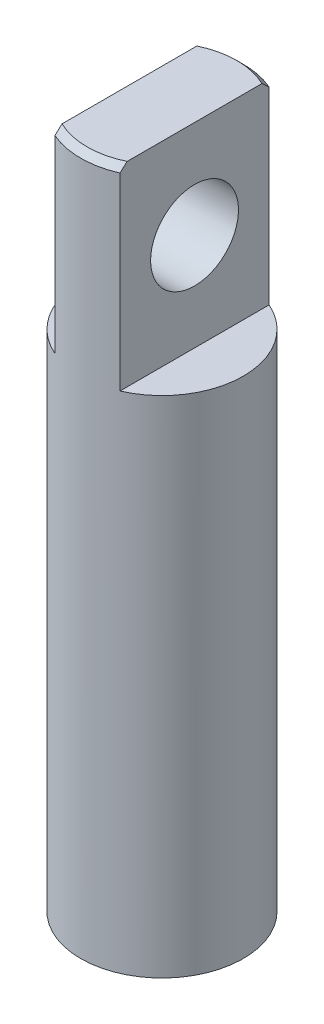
ISO-10303-21;
HEADER;
FILE_DESCRIPTION(('STEP AP214'),'2;1');
FILE_NAME('part.step','',(''),(''),'','','');
FILE_SCHEMA(('AUTOMOTIVE_DESIGN { 1 0 10303 214 1 1 1 1 }'));
ENDSEC;
DATA;
#1=APPLICATION_CONTEXT('core data for automotive mechanical design processes');
#2=APPLICATION_PROTOCOL_DEFINITION('international standard','automotive_design',2000,#1);
#3=PRODUCT_CONTEXT('',#1,'mechanical');
#4=PRODUCT('Part','Part','',(#3));
#5=PRODUCT_RELATED_PRODUCT_CATEGORY('part','',(#4));
#6=PRODUCT_DEFINITION_FORMATION('','',#4);
#7=PRODUCT_DEFINITION_CONTEXT('part definition',#1,'design');
#8=PRODUCT_DEFINITION('design','',#6,#7);
#9=PRODUCT_DEFINITION_SHAPE('','',#8);
#10=(LENGTH_UNIT() NAMED_UNIT(*) SI_UNIT(.MILLI.,.METRE.));
#11=(NAMED_UNIT(*) PLANE_ANGLE_UNIT() SI_UNIT($,.RADIAN.));
#12=(NAMED_UNIT(*) SI_UNIT($,.STERADIAN.) SOLID_ANGLE_UNIT());
#13=UNCERTAINTY_MEASURE_WITH_UNIT(LENGTH_MEASURE(1.E-05),#10,'distance_accuracy_value','');
#14=(GEOMETRIC_REPRESENTATION_CONTEXT(3) GLOBAL_UNCERTAINTY_ASSIGNED_CONTEXT((#13)) GLOBAL_UNIT_ASSIGNED_CONTEXT((#10,
#11,#12)) REPRESENTATION_CONTEXT('',''));
#15=CARTESIAN_POINT('',(0.,0.,0.));
#16=DIRECTION('',(0.,0.,1.));
#17=DIRECTION('',(1.,0.,0.));
#18=AXIS2_PLACEMENT_3D('',#15,#16,#17);
#19=CARTESIAN_POINT('',(0.,15.5,0.));
#20=DIRECTION('',(0.,1.,0.));
#21=DIRECTION('',(0.,0.,1.));
#22=AXIS2_PLACEMENT_3D('',#19,#20,#21);
#23=PLANE('',#22);
#24=DIRECTION('',(0.,0.,-1.));
#25=VECTOR('',#24,1.);
#26=CARTESIAN_POINT('',(1.,15.5,2.29128784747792));
#27=LINE('',#26,#25);
#28=CARTESIAN_POINT('',(1.,15.5,2.29128784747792));
#29=VERTEX_POINT('',#28);
#30=CARTESIAN_POINT('',(1.,15.5,-2.29128784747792));
#31=VERTEX_POINT('',#30);
#32=EDGE_CURVE('E110',#29,#31,#27,.T.);
#33=ORIENTED_EDGE('',*,*,#32,.F.);
#34=CARTESIAN_POINT('',(0.,15.5,0.));
#35=DIRECTION('',(0.,1.,0.));
#36=DIRECTION('',(0.,0.,1.));
#37=AXIS2_PLACEMENT_3D('',#34,#35,#36);
#38=CIRCLE('',#37,2.5);
#39=EDGE_CURVE('E105',#29,#31,#38,.T.);
#40=ORIENTED_EDGE('',*,*,#39,.T.);
#41=EDGE_LOOP('',(#33,#40));
#42=FACE_BOUND('',#41,.T.);
#43=ADVANCED_FACE('F32',(#42),#23,.T.);
#44=CARTESIAN_POINT('',(0.,15.5,0.));
#45=DIRECTION('',(0.,-1.,0.));
#46=DIRECTION('',(0.,0.,-1.));
#47=AXIS2_PLACEMENT_3D('',#44,#45,#46);
#48=CYLINDRICAL_SURFACE('',#47,2.5);
#49=DIRECTION('',(0.,-1.,0.));
#50=VECTOR('',#49,1.);
#51=CARTESIAN_POINT('',(-1.,21.5,-2.29128784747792));
#52=LINE('',#51,#50);
#53=CARTESIAN_POINT('',(-1.,21.3,-2.29128784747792));
#54=VERTEX_POINT('',#53);
#55=CARTESIAN_POINT('',(-1.,15.5,-2.29128784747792));
#56=VERTEX_POINT('',#55);
#57=EDGE_CURVE('E98',#54,#56,#52,.T.);
#58=ORIENTED_EDGE('',*,*,#57,.F.);
#59=CARTESIAN_POINT('',(0.,21.3,0.));
#60=DIRECTION('',(0.,1.,0.));
#61=DIRECTION('',(0.,0.,1.));
#62=AXIS2_PLACEMENT_3D('',#59,#60,#61);
#63=CIRCLE('',#62,2.5);
#64=CARTESIAN_POINT('',(1.,21.3,-2.29128784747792));
#65=VERTEX_POINT('',#64);
#66=EDGE_CURVE('E52',#54,#65,#63,.F.);
#67=ORIENTED_EDGE('',*,*,#66,.T.);
#68=DIRECTION('',(0.,-1.,0.));
#69=VECTOR('',#68,1.);
#70=CARTESIAN_POINT('',(1.,21.5,-2.29128784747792));
#71=LINE('',#70,#69);
#72=EDGE_CURVE('E139',#65,#31,#71,.T.);
#73=ORIENTED_EDGE('',*,*,#72,.T.);
#74=ORIENTED_EDGE('',*,*,#39,.F.);
#75=DIRECTION('',(0.,-1.,0.));
#76=VECTOR('',#75,1.);
#77=CARTESIAN_POINT('',(1.,21.5,2.29128784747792));
#78=LINE('',#77,#76);
#79=CARTESIAN_POINT('',(1.,21.3,2.29128784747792));
#80=VERTEX_POINT('',#79);
#81=EDGE_CURVE('E99',#80,#29,#78,.T.);
#82=ORIENTED_EDGE('',*,*,#81,.F.);
#83=CARTESIAN_POINT('',(0.,21.3,0.));
#84=DIRECTION('',(0.,1.,0.));
#85=DIRECTION('',(0.,0.,1.));
#86=AXIS2_PLACEMENT_3D('',#83,#84,#85);
#87=CIRCLE('',#86,2.5);
#88=CARTESIAN_POINT('',(-1.,21.3,2.29128784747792));
#89=VERTEX_POINT('',#88);
#90=EDGE_CURVE('E94',#80,#89,#87,.F.);
#91=ORIENTED_EDGE('',*,*,#90,.T.);
#92=DIRECTION('',(0.,-1.,0.));
#93=VECTOR('',#92,1.);
#94=CARTESIAN_POINT('',(-1.,21.5,2.29128784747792));
#95=LINE('',#94,#93);
#96=CARTESIAN_POINT('',(-1.,15.5,2.29128784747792));
#97=VERTEX_POINT('',#96);
#98=EDGE_CURVE('E88',#89,#97,#95,.T.);
#99=ORIENTED_EDGE('',*,*,#98,.T.);
#100=EDGE_CURVE('E92',#56,#97,#38,.T.);
#101=ORIENTED_EDGE('',*,*,#100,.F.);
#102=EDGE_LOOP('',(#58,#67,#73,#74,#82,#91,#99,#101));
#103=FACE_BOUND('',#102,.T.);
#104=CARTESIAN_POINT('',(0.,0.,0.));
#105=DIRECTION('',(0.,1.,0.));
#106=DIRECTION('',(0.,0.,1.));
#107=AXIS2_PLACEMENT_3D('',#104,#105,#106);
#108=CIRCLE('',#107,2.5);
#109=CARTESIAN_POINT('',(0.,0.,2.5));
#110=VERTEX_POINT('',#109);
#111=EDGE_CURVE('E106',#110,#110,#108,.T.);
#112=ORIENTED_EDGE('',*,*,#111,.T.);
#113=EDGE_LOOP('',(#112));
#114=FACE_BOUND('',#113,.T.);
#115=ADVANCED_FACE('F90',(#103,#114),#48,.T.);
#116=DIRECTION('',(0.,0.,1.));
#117=VECTOR('',#116,1.);
#118=CARTESIAN_POINT('',(-1.,15.5,2.29128784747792));
#119=LINE('',#118,#117);
#120=EDGE_CURVE('E104',#56,#97,#119,.T.);
#121=ORIENTED_EDGE('',*,*,#120,.F.);
#122=ORIENTED_EDGE('',*,*,#100,.T.);
#123=EDGE_LOOP('',(#121,#122));
#124=FACE_BOUND('',#123,.T.);
#125=ADVANCED_FACE('F103',(#124),#23,.T.);
#126=CARTESIAN_POINT('',(0.,0.,0.));
#127=DIRECTION('',(0.,1.,0.));
#128=DIRECTION('',(0.,0.,1.));
#129=AXIS2_PLACEMENT_3D('',#126,#127,#128);
#130=PLANE('',#129);
#131=ORIENTED_EDGE('',*,*,#111,.F.);
#132=EDGE_LOOP('',(#131));
#133=FACE_BOUND('',#132,.T.);
#134=ADVANCED_FACE('F160',(#133),#130,.F.);
#135=CARTESIAN_POINT('',(-1.,21.5,2.29128784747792));
#136=DIRECTION('',(1.,0.,0.));
#137=DIRECTION('',(0.,0.,-1.));
#138=AXIS2_PLACEMENT_3D('',#135,#136,#137);
#139=PLANE('',#138);
#140=CARTESIAN_POINT('',(-1.,18.5,0.));
#141=DIRECTION('',(-1.,0.,0.));
#142=DIRECTION('',(0.,0.,1.));
#143=AXIS2_PLACEMENT_3D('',#140,#141,#142);
#144=CIRCLE('',#143,1.35);
#145=CARTESIAN_POINT('',(-1.,18.5,1.35));
#146=VERTEX_POINT('',#145);
#147=EDGE_CURVE('E117',#146,#146,#144,.T.);
#148=ORIENTED_EDGE('',*,*,#147,.F.);
#149=EDGE_LOOP('',(#148));
#150=FACE_BOUND('',#149,.T.);
#151=DIRECTION('',(0.,0.,1.));
#152=VECTOR('',#151,1.);
#153=CARTESIAN_POINT('',(-1.,21.5,2.29128784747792));
#154=LINE('',#153,#152);
#155=CARTESIAN_POINT('',(-1.,21.5,-2.0712315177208));
#156=VERTEX_POINT('',#155);
#157=CARTESIAN_POINT('',(-1.,21.5,2.07123151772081));
#158=VERTEX_POINT('',#157);
#159=EDGE_CURVE('E114',#156,#158,#154,.T.);
#160=ORIENTED_EDGE('',*,*,#159,.F.);
#161=CARTESIAN_POINT('',(-1.,21.5,-2.0712315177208));
#162=CARTESIAN_POINT('',(-1.,21.4668268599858,-2.10805317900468));
#163=CARTESIAN_POINT('',(-1.,21.4335736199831,-2.14480204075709));
#164=CARTESIAN_POINT('',(-1.,21.3669069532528,-2.21815415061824));
#165=CARTESIAN_POINT('',(-1.,21.3334935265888,-2.25475739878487));
#166=CARTESIAN_POINT('',(-1.,21.3,-2.29128784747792));
#167=B_SPLINE_CURVE_WITH_KNOTS('',3,(#161,#162,#163,#164,#165,#166),.UNSPECIFIED.,.F.,.F.,(4,2,
4),(0.,0.148681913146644,0.29736376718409),.UNSPECIFIED.);
#168=EDGE_CURVE('E144',#156,#54,#167,.T.);
#169=ORIENTED_EDGE('',*,*,#168,.T.);
#170=ORIENTED_EDGE('',*,*,#57,.T.);
#171=ORIENTED_EDGE('',*,*,#120,.T.);
#172=ORIENTED_EDGE('',*,*,#98,.F.);
#173=CARTESIAN_POINT('',(-1.,21.3,2.29128784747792));
#174=CARTESIAN_POINT('',(-1.,21.3334935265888,2.25475739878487));
#175=CARTESIAN_POINT('',(-1.,21.3669069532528,2.21815415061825));
#176=CARTESIAN_POINT('',(-1.,21.4335736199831,2.14480204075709));
#177=CARTESIAN_POINT('',(-1.,21.4668268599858,2.10805317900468));
#178=CARTESIAN_POINT('',(-1.,21.5,2.07123151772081));
#179=B_SPLINE_CURVE_WITH_KNOTS('',3,(#173,#174,#175,#176,#177,#178),.UNSPECIFIED.,.F.,.F.,(4,2,
4),(0.,0.148681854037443,0.297363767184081),.UNSPECIFIED.);
#180=EDGE_CURVE('E165',#89,#158,#179,.T.);
#181=ORIENTED_EDGE('',*,*,#180,.T.);
#182=EDGE_LOOP('',(#160,#169,#170,#171,#172,#181));
#183=FACE_BOUND('',#182,.T.);
#184=ADVANCED_FACE('F109',(#150,#183),#139,.F.);
#185=CARTESIAN_POINT('',(1.,21.5,2.29128784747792));
#186=DIRECTION('',(-1.,0.,0.));
#187=DIRECTION('',(0.,0.,1.));
#188=AXIS2_PLACEMENT_3D('',#185,#186,#187);
#189=PLANE('',#188);
#190=CARTESIAN_POINT('',(1.,18.5,0.));
#191=DIRECTION('',(-1.,0.,0.));
#192=DIRECTION('',(0.,0.,1.));
#193=AXIS2_PLACEMENT_3D('',#190,#191,#192);
#194=CIRCLE('',#193,1.35);
#195=CARTESIAN_POINT('',(1.,18.5,1.35));
#196=VERTEX_POINT('',#195);
#197=EDGE_CURVE('E111',#196,#196,#194,.T.);
#198=ORIENTED_EDGE('',*,*,#197,.T.);
#199=EDGE_LOOP('',(#198));
#200=FACE_BOUND('',#199,.T.);
#201=ORIENTED_EDGE('',*,*,#72,.F.);
#202=CARTESIAN_POINT('',(1.,21.3,-2.29128784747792));
#203=CARTESIAN_POINT('',(1.,21.3334935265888,-2.25475739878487));
#204=CARTESIAN_POINT('',(1.,21.3669069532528,-2.21815415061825));
#205=CARTESIAN_POINT('',(1.,21.4335736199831,-2.14480204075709));
#206=CARTESIAN_POINT('',(1.,21.4668268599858,-2.10805317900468));
#207=CARTESIAN_POINT('',(1.,21.5,-2.0712315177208));
#208=B_SPLINE_CURVE_WITH_KNOTS('',3,(#202,#203,#204,#205,#206,#207),.UNSPECIFIED.,.F.,.F.,(4,2,
4),(0.,0.148681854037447,0.29736376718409),.UNSPECIFIED.);
#209=CARTESIAN_POINT('',(1.,21.5,-2.0712315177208));
#210=VERTEX_POINT('',#209);
#211=EDGE_CURVE('E11',#65,#210,#208,.T.);
#212=ORIENTED_EDGE('',*,*,#211,.T.);
#213=DIRECTION('',(0.,0.,-1.));
#214=VECTOR('',#213,1.);
#215=CARTESIAN_POINT('',(1.,21.5,2.29128784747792));
#216=LINE('',#215,#214);
#217=CARTESIAN_POINT('',(1.,21.5,2.07123151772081));
#218=VERTEX_POINT('',#217);
#219=EDGE_CURVE('E127',#218,#210,#216,.T.);
#220=ORIENTED_EDGE('',*,*,#219,.F.);
#221=CARTESIAN_POINT('',(1.,21.5,2.07123151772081));
#222=CARTESIAN_POINT('',(1.,21.4668268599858,2.10805317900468));
#223=CARTESIAN_POINT('',(1.,21.4335736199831,2.14480204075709));
#224=CARTESIAN_POINT('',(1.,21.3669069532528,2.21815415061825));
#225=CARTESIAN_POINT('',(1.,21.3334935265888,2.25475739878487));
#226=CARTESIAN_POINT('',(1.,21.3,2.29128784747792));
#227=B_SPLINE_CURVE_WITH_KNOTS('',3,(#221,#222,#223,#224,#225,#226),.UNSPECIFIED.,.F.,.F.,(4,2,
4),(0.,0.148681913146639,0.297363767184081),.UNSPECIFIED.);
#228=EDGE_CURVE('E45',#218,#80,#227,.T.);
#229=ORIENTED_EDGE('',*,*,#228,.T.);
#230=ORIENTED_EDGE('',*,*,#81,.T.);
#231=ORIENTED_EDGE('',*,*,#32,.T.);
#232=EDGE_LOOP('',(#201,#212,#220,#229,#230,#231));
#233=FACE_BOUND('',#232,.T.);
#234=ADVANCED_FACE('F148',(#200,#233),#189,.F.);
#235=CARTESIAN_POINT('',(0.,21.5,0.));
#236=DIRECTION('',(0.,1.,0.));
#237=DIRECTION('',(0.,0.,1.));
#238=AXIS2_PLACEMENT_3D('',#235,#236,#237);
#239=PLANE('',#238);
#240=ORIENTED_EDGE('',*,*,#219,.T.);
#241=CARTESIAN_POINT('',(0.,21.5,0.));
#242=DIRECTION('',(0.,1.,0.));
#243=DIRECTION('',(0.,0.,1.));
#244=AXIS2_PLACEMENT_3D('',#241,#242,#243);
#245=CIRCLE('',#244,2.30000000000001);
#246=EDGE_CURVE('E196',#210,#156,#245,.T.);
#247=ORIENTED_EDGE('',*,*,#246,.T.);
#248=ORIENTED_EDGE('',*,*,#159,.T.);
#249=CARTESIAN_POINT('',(0.,21.5,0.));
#250=DIRECTION('',(0.,1.,0.));
#251=DIRECTION('',(0.,0.,1.));
#252=AXIS2_PLACEMENT_3D('',#249,#250,#251);
#253=CIRCLE('',#252,2.30000000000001);
#254=EDGE_CURVE('E194',#158,#218,#253,.T.);
#255=ORIENTED_EDGE('',*,*,#254,.T.);
#256=EDGE_LOOP('',(#240,#247,#248,#255));
#257=FACE_BOUND('',#256,.T.);
#258=ADVANCED_FACE('F153',(#257),#239,.T.);
#259=CARTESIAN_POINT('',(1.,18.5,0.));
#260=DIRECTION('',(-1.,0.,0.));
#261=DIRECTION('',(0.,0.,1.));
#262=AXIS2_PLACEMENT_3D('',#259,#260,#261);
#263=CYLINDRICAL_SURFACE('',#262,1.35);
#264=ORIENTED_EDGE('',*,*,#197,.F.);
#265=EDGE_LOOP('',(#264));
#266=FACE_BOUND('',#265,.T.);
#267=ORIENTED_EDGE('',*,*,#147,.T.);
#268=EDGE_LOOP('',(#267));
#269=FACE_BOUND('',#268,.T.);
#270=ADVANCED_FACE('F177',(#266,#269),#263,.F.);
#271=CARTESIAN_POINT('',(0.,21.5,0.));
#272=DIRECTION('',(0.,-1.,0.));
#273=DIRECTION('',(0.,0.,-1.));
#274=AXIS2_PLACEMENT_3D('',#271,#272,#273);
#275=CONICAL_SURFACE('',#274,2.30000000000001,0.785398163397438);
#276=ORIENTED_EDGE('',*,*,#211,.F.);
#277=ORIENTED_EDGE('',*,*,#66,.F.);
#278=ORIENTED_EDGE('',*,*,#168,.F.);
#279=ORIENTED_EDGE('',*,*,#246,.F.);
#280=EDGE_LOOP('',(#276,#277,#278,#279));
#281=FACE_BOUND('',#280,.T.);
#282=ADVANCED_FACE('F173',(#281),#275,.T.);
#283=CARTESIAN_POINT('',(0.,21.5,0.));
#284=DIRECTION('',(0.,-1.,0.));
#285=DIRECTION('',(0.,0.,-1.));
#286=AXIS2_PLACEMENT_3D('',#283,#284,#285);
#287=CONICAL_SURFACE('',#286,2.30000000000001,0.785398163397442);
#288=ORIENTED_EDGE('',*,*,#180,.F.);
#289=ORIENTED_EDGE('',*,*,#90,.F.);
#290=ORIENTED_EDGE('',*,*,#228,.F.);
#291=ORIENTED_EDGE('',*,*,#254,.F.);
#292=EDGE_LOOP('',(#288,#289,#290,#291));
#293=FACE_BOUND('',#292,.T.);
#294=ADVANCED_FACE('F34',(#293),#287,.T.);
#295=CLOSED_SHELL('',(#43,#115,#125,#134,#184,#234,#258,#270,#282,#294));
#296=MANIFOLD_SOLID_BREP('B2',#295);
#297=ADVANCED_BREP_SHAPE_REPRESENTATION('',(#18,#296),#14);
#298=SHAPE_DEFINITION_REPRESENTATION(#9,#297);
ENDSEC;
END-ISO-10303-21;
